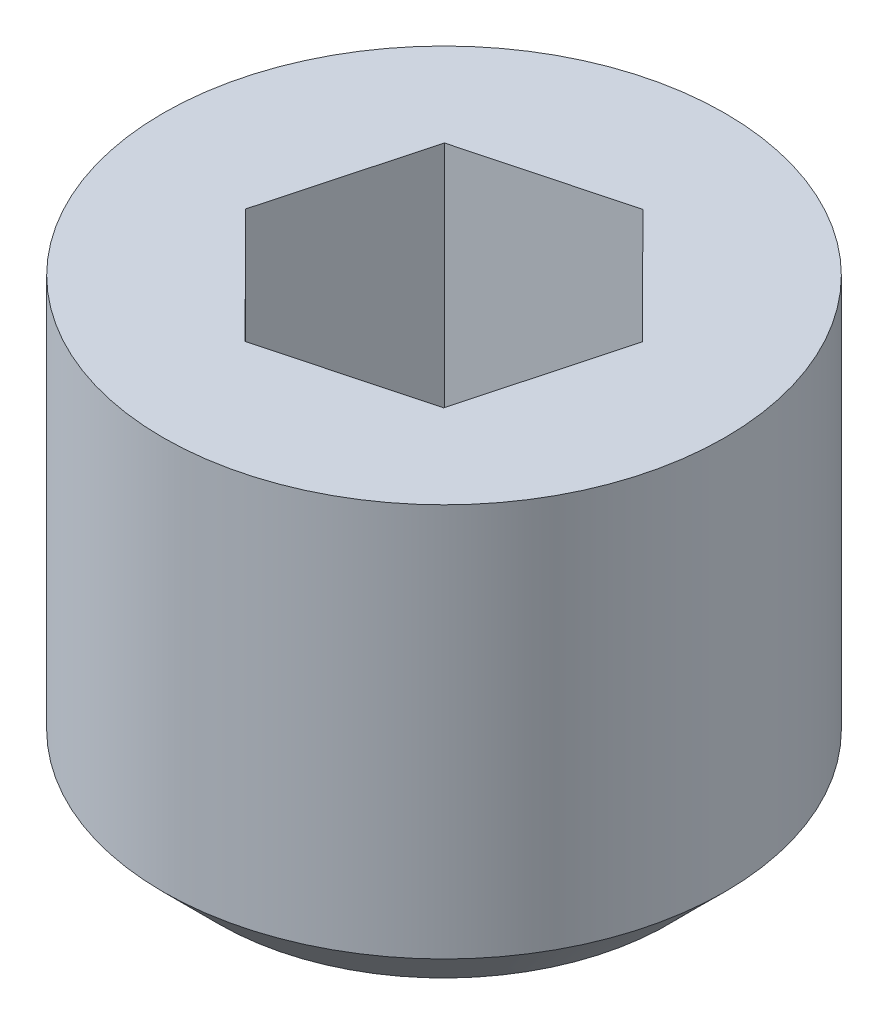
ISO-10303-21;
HEADER;
FILE_DESCRIPTION(('STEP AP214'),'2;1');
FILE_NAME('part.step','',(''),(''),'','','');
FILE_SCHEMA(('AUTOMOTIVE_DESIGN { 1 0 10303 214 1 1 1 1 }'));
ENDSEC;
DATA;
#1=APPLICATION_CONTEXT('core data for automotive mechanical design processes');
#2=APPLICATION_PROTOCOL_DEFINITION('international standard','automotive_design',2000,#1);
#3=PRODUCT_CONTEXT('',#1,'mechanical');
#4=PRODUCT('Part','Part','',(#3));
#5=PRODUCT_RELATED_PRODUCT_CATEGORY('part','',(#4));
#6=PRODUCT_DEFINITION_FORMATION('','',#4);
#7=PRODUCT_DEFINITION_CONTEXT('part definition',#1,'design');
#8=PRODUCT_DEFINITION('design','',#6,#7);
#9=PRODUCT_DEFINITION_SHAPE('','',#8);
#10=(LENGTH_UNIT() NAMED_UNIT(*) SI_UNIT(.MILLI.,.METRE.));
#11=(NAMED_UNIT(*) PLANE_ANGLE_UNIT() SI_UNIT($,.RADIAN.));
#12=(NAMED_UNIT(*) SI_UNIT($,.STERADIAN.) SOLID_ANGLE_UNIT());
#13=UNCERTAINTY_MEASURE_WITH_UNIT(LENGTH_MEASURE(1.E-05),#10,'distance_accuracy_value','');
#14=(GEOMETRIC_REPRESENTATION_CONTEXT(3) GLOBAL_UNCERTAINTY_ASSIGNED_CONTEXT((#13)) GLOBAL_UNIT_ASSIGNED_CONTEXT((#10,
#11,#12)) REPRESENTATION_CONTEXT('',''));
#15=CARTESIAN_POINT('',(0.,0.,0.));
#16=DIRECTION('',(0.,0.,1.));
#17=DIRECTION('',(1.,0.,0.));
#18=AXIS2_PLACEMENT_3D('',#15,#16,#17);
#19=CARTESIAN_POINT('',(2.,0.,0.));
#20=DIRECTION('',(0.,-1.,0.));
#21=DIRECTION('',(0.,0.,-1.));
#22=AXIS2_PLACEMENT_3D('',#19,#20,#21);
#23=PLANE('',#22);
#24=CARTESIAN_POINT('',(0.,0.,0.));
#25=DIRECTION('',(0.,-1.,0.));
#26=DIRECTION('',(0.,0.,-1.));
#27=AXIS2_PLACEMENT_3D('',#24,#25,#26);
#28=CIRCLE('',#27,2.);
#29=CARTESIAN_POINT('',(0.,0.,-2.));
#30=VERTEX_POINT('',#29);
#31=EDGE_CURVE('E136',#30,#30,#28,.T.);
#32=ORIENTED_EDGE('',*,*,#31,.T.);
#33=EDGE_LOOP('',(#32));
#34=FACE_BOUND('',#33,.T.);
#35=ADVANCED_FACE('F35',(#34),#23,.T.);
#36=CARTESIAN_POINT('',(0.,4.,0.));
#37=DIRECTION('',(0.,1.,0.));
#38=DIRECTION('',(0.,0.,1.));
#39=AXIS2_PLACEMENT_3D('',#36,#37,#38);
#40=PLANE('',#39);
#41=DIRECTION('',(0.966397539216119,0.,-0.25705212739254));
#42=VECTOR('',#41,1.);
#43=CARTESIAN_POINT('',(-0.376122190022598,4.,1.39350831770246));
#44=LINE('',#43,#42);
#45=CARTESIAN_POINT('',(-0.376122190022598,4.,1.39350831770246));
#46=VERTEX_POINT('',#45);
#47=CARTESIAN_POINT('',(1.01875250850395,4.,1.02248553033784));
#48=VERTEX_POINT('',#47);
#49=EDGE_CURVE('E49',#46,#48,#44,.T.);
#50=ORIENTED_EDGE('',*,*,#49,.F.);
#51=DIRECTION('',(0.705812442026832,0.,0.708398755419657));
#52=VECTOR('',#51,1.);
#53=CARTESIAN_POINT('',(-1.39487469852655,4.,0.371022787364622));
#54=LINE('',#53,#52);
#55=CARTESIAN_POINT('',(-1.39487469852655,4.,0.371022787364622));
#56=VERTEX_POINT('',#55);
#57=EDGE_CURVE('E132',#56,#46,#54,.T.);
#58=ORIENTED_EDGE('',*,*,#57,.F.);
#59=DIRECTION('',(-0.260585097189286,0.,0.965450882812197));
#60=VECTOR('',#59,1.);
#61=CARTESIAN_POINT('',(-1.01875250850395,4.,-1.02248553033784));
#62=LINE('',#61,#60);
#63=CARTESIAN_POINT('',(-1.01875250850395,4.,-1.02248553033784));
#64=VERTEX_POINT('',#63);
#65=EDGE_CURVE('E130',#64,#56,#62,.T.);
#66=ORIENTED_EDGE('',*,*,#65,.F.);
#67=DIRECTION('',(-0.966397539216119,0.,0.25705212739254));
#68=VECTOR('',#67,1.);
#69=CARTESIAN_POINT('',(0.376122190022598,4.,-1.39350831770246));
#70=LINE('',#69,#68);
#71=CARTESIAN_POINT('',(0.376122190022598,4.,-1.39350831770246));
#72=VERTEX_POINT('',#71);
#73=EDGE_CURVE('E97',#72,#64,#70,.T.);
#74=ORIENTED_EDGE('',*,*,#73,.F.);
#75=DIRECTION('',(-0.705812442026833,0.,-0.708398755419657));
#76=VECTOR('',#75,1.);
#77=CARTESIAN_POINT('',(1.39487469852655,4.,-0.371022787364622));
#78=LINE('',#77,#76);
#79=CARTESIAN_POINT('',(1.39487469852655,4.,-0.371022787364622));
#80=VERTEX_POINT('',#79);
#81=EDGE_CURVE('E126',#80,#72,#78,.T.);
#82=ORIENTED_EDGE('',*,*,#81,.F.);
#83=DIRECTION('',(0.260585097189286,0.,-0.965450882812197));
#84=VECTOR('',#83,1.);
#85=CARTESIAN_POINT('',(1.01875250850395,4.,1.02248553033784));
#86=LINE('',#85,#84);
#87=EDGE_CURVE('E123',#48,#80,#86,.T.);
#88=ORIENTED_EDGE('',*,*,#87,.F.);
#89=EDGE_LOOP('',(#50,#58,#66,#74,#82,#88));
#90=FACE_BOUND('',#89,.T.);
#91=CARTESIAN_POINT('',(0.,4.,0.));
#92=DIRECTION('',(0.,-1.,0.));
#93=DIRECTION('',(0.,0.,-1.));
#94=AXIS2_PLACEMENT_3D('',#91,#92,#93);
#95=CIRCLE('',#94,2.5);
#96=CARTESIAN_POINT('',(0.,4.,-2.5));
#97=VERTEX_POINT('',#96);
#98=EDGE_CURVE('E11',#97,#97,#95,.T.);
#99=ORIENTED_EDGE('',*,*,#98,.F.);
#100=EDGE_LOOP('',(#99));
#101=FACE_BOUND('',#100,.T.);
#102=ADVANCED_FACE('F151',(#90,#101),#40,.T.);
#103=CARTESIAN_POINT('',(0.,0.,0.));
#104=DIRECTION('',(0.,-1.,0.));
#105=DIRECTION('',(0.,0.,-1.));
#106=AXIS2_PLACEMENT_3D('',#103,#104,#105);
#107=CYLINDRICAL_SURFACE('',#106,2.5);
#108=ORIENTED_EDGE('',*,*,#98,.T.);
#109=EDGE_LOOP('',(#108));
#110=FACE_BOUND('',#109,.T.);
#111=CARTESIAN_POINT('',(0.,0.499999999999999,0.));
#112=DIRECTION('',(0.,-1.,0.));
#113=DIRECTION('',(0.,0.,-1.));
#114=AXIS2_PLACEMENT_3D('',#111,#112,#113);
#115=CIRCLE('',#114,2.5);
#116=CARTESIAN_POINT('',(0.,0.499999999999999,-2.5));
#117=VERTEX_POINT('',#116);
#118=EDGE_CURVE('E42',#117,#117,#115,.T.);
#119=ORIENTED_EDGE('',*,*,#118,.F.);
#120=EDGE_LOOP('',(#119));
#121=FACE_BOUND('',#120,.T.);
#122=ADVANCED_FACE('F149',(#110,#121),#107,.T.);
#123=CARTESIAN_POINT('',(0.,0.,0.));
#124=DIRECTION('',(0.,1.,0.));
#125=DIRECTION('',(0.,0.,1.));
#126=AXIS2_PLACEMENT_3D('',#123,#124,#125);
#127=CONICAL_SURFACE('',#126,2.,0.785398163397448);
#128=ORIENTED_EDGE('',*,*,#118,.T.);
#129=EDGE_LOOP('',(#128));
#130=FACE_BOUND('',#129,.T.);
#131=ORIENTED_EDGE('',*,*,#31,.F.);
#132=EDGE_LOOP('',(#131));
#133=FACE_BOUND('',#132,.T.);
#134=ADVANCED_FACE('F146',(#130,#133),#127,.T.);
#135=CARTESIAN_POINT('',(-0.376122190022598,1.5,1.39350831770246));
#136=DIRECTION('',(0.25705212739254,0.,0.966397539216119));
#137=DIRECTION('',(0.966397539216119,0.,-0.25705212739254));
#138=AXIS2_PLACEMENT_3D('',#135,#136,#137);
#139=PLANE('',#138);
#140=ORIENTED_EDGE('',*,*,#49,.T.);
#141=DIRECTION('',(0.,1.,0.));
#142=VECTOR('',#141,1.);
#143=CARTESIAN_POINT('',(1.01875250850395,1.5,1.02248553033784));
#144=LINE('',#143,#142);
#145=CARTESIAN_POINT('',(1.01875250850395,1.5,1.02248553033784));
#146=VERTEX_POINT('',#145);
#147=EDGE_CURVE('E79',#146,#48,#144,.T.);
#148=ORIENTED_EDGE('',*,*,#147,.F.);
#149=DIRECTION('',(0.966397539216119,0.,-0.25705212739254));
#150=VECTOR('',#149,1.);
#151=CARTESIAN_POINT('',(-0.376122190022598,1.5,1.39350831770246));
#152=LINE('',#151,#150);
#153=CARTESIAN_POINT('',(-0.376122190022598,1.5,1.39350831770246));
#154=VERTEX_POINT('',#153);
#155=EDGE_CURVE('E134',#154,#146,#152,.T.);
#156=ORIENTED_EDGE('',*,*,#155,.F.);
#157=DIRECTION('',(0.,1.,0.));
#158=VECTOR('',#157,1.);
#159=CARTESIAN_POINT('',(-0.376122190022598,1.5,1.39350831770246));
#160=LINE('',#159,#158);
#161=EDGE_CURVE('E57',#154,#46,#160,.T.);
#162=ORIENTED_EDGE('',*,*,#161,.T.);
#163=EDGE_LOOP('',(#140,#148,#156,#162));
#164=FACE_BOUND('',#163,.T.);
#165=ADVANCED_FACE('F158',(#164),#139,.F.);
#166=CARTESIAN_POINT('',(-1.39487469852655,1.5,0.371022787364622));
#167=DIRECTION('',(-0.708398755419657,0.,0.705812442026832));
#168=DIRECTION('',(0.705812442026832,0.,0.708398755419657));
#169=AXIS2_PLACEMENT_3D('',#166,#167,#168);
#170=PLANE('',#169);
#171=ORIENTED_EDGE('',*,*,#57,.T.);
#172=ORIENTED_EDGE('',*,*,#161,.F.);
#173=DIRECTION('',(0.705812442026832,0.,0.708398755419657));
#174=VECTOR('',#173,1.);
#175=CARTESIAN_POINT('',(-1.39487469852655,1.5,0.371022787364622));
#176=LINE('',#175,#174);
#177=CARTESIAN_POINT('',(-1.39487469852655,1.5,0.371022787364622));
#178=VERTEX_POINT('',#177);
#179=EDGE_CURVE('E109',#178,#154,#176,.T.);
#180=ORIENTED_EDGE('',*,*,#179,.F.);
#181=DIRECTION('',(0.,1.,0.));
#182=VECTOR('',#181,1.);
#183=CARTESIAN_POINT('',(-1.39487469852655,1.5,0.371022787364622));
#184=LINE('',#183,#182);
#185=EDGE_CURVE('E101',#178,#56,#184,.T.);
#186=ORIENTED_EDGE('',*,*,#185,.T.);
#187=EDGE_LOOP('',(#171,#172,#180,#186));
#188=FACE_BOUND('',#187,.T.);
#189=ADVANCED_FACE('F183',(#188),#170,.F.);
#190=CARTESIAN_POINT('',(-1.01875250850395,1.5,-1.02248553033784));
#191=DIRECTION('',(-0.965450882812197,0.,-0.260585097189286));
#192=DIRECTION('',(-0.260585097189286,0.,0.965450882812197));
#193=AXIS2_PLACEMENT_3D('',#190,#191,#192);
#194=PLANE('',#193);
#195=ORIENTED_EDGE('',*,*,#65,.T.);
#196=ORIENTED_EDGE('',*,*,#185,.F.);
#197=DIRECTION('',(-0.260585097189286,0.,0.965450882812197));
#198=VECTOR('',#197,1.);
#199=CARTESIAN_POINT('',(-1.01875250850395,1.5,-1.02248553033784));
#200=LINE('',#199,#198);
#201=CARTESIAN_POINT('',(-1.01875250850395,1.5,-1.02248553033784));
#202=VERTEX_POINT('',#201);
#203=EDGE_CURVE('E105',#202,#178,#200,.T.);
#204=ORIENTED_EDGE('',*,*,#203,.F.);
#205=DIRECTION('',(0.,1.,0.));
#206=VECTOR('',#205,1.);
#207=CARTESIAN_POINT('',(-1.01875250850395,1.5,-1.02248553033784));
#208=LINE('',#207,#206);
#209=EDGE_CURVE('E90',#202,#64,#208,.T.);
#210=ORIENTED_EDGE('',*,*,#209,.T.);
#211=EDGE_LOOP('',(#195,#196,#204,#210));
#212=FACE_BOUND('',#211,.T.);
#213=ADVANCED_FACE('F106',(#212),#194,.F.);
#214=CARTESIAN_POINT('',(0.376122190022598,1.5,-1.39350831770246));
#215=DIRECTION('',(-0.25705212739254,0.,-0.966397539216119));
#216=DIRECTION('',(-0.966397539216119,0.,0.25705212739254));
#217=AXIS2_PLACEMENT_3D('',#214,#215,#216);
#218=PLANE('',#217);
#219=ORIENTED_EDGE('',*,*,#73,.T.);
#220=ORIENTED_EDGE('',*,*,#209,.F.);
#221=DIRECTION('',(-0.966397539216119,0.,0.25705212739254));
#222=VECTOR('',#221,1.);
#223=CARTESIAN_POINT('',(0.376122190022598,1.5,-1.39350831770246));
#224=LINE('',#223,#222);
#225=CARTESIAN_POINT('',(0.376122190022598,1.5,-1.39350831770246));
#226=VERTEX_POINT('',#225);
#227=EDGE_CURVE('E94',#226,#202,#224,.T.);
#228=ORIENTED_EDGE('',*,*,#227,.F.);
#229=DIRECTION('',(0.,1.,0.));
#230=VECTOR('',#229,1.);
#231=CARTESIAN_POINT('',(0.376122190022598,1.5,-1.39350831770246));
#232=LINE('',#231,#230);
#233=EDGE_CURVE('E102',#226,#72,#232,.T.);
#234=ORIENTED_EDGE('',*,*,#233,.T.);
#235=EDGE_LOOP('',(#219,#220,#228,#234));
#236=FACE_BOUND('',#235,.T.);
#237=ADVANCED_FACE('F92',(#236),#218,.F.);
#238=CARTESIAN_POINT('',(1.39487469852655,1.5,-0.371022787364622));
#239=DIRECTION('',(0.708398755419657,0.,-0.705812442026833));
#240=DIRECTION('',(-0.705812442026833,0.,-0.708398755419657));
#241=AXIS2_PLACEMENT_3D('',#238,#239,#240);
#242=PLANE('',#241);
#243=ORIENTED_EDGE('',*,*,#81,.T.);
#244=ORIENTED_EDGE('',*,*,#233,.F.);
#245=DIRECTION('',(-0.705812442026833,0.,-0.708398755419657));
#246=VECTOR('',#245,1.);
#247=CARTESIAN_POINT('',(1.39487469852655,1.5,-0.371022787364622));
#248=LINE('',#247,#246);
#249=CARTESIAN_POINT('',(1.39487469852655,1.5,-0.371022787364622));
#250=VERTEX_POINT('',#249);
#251=EDGE_CURVE('E115',#250,#226,#248,.T.);
#252=ORIENTED_EDGE('',*,*,#251,.F.);
#253=DIRECTION('',(0.,1.,0.));
#254=VECTOR('',#253,1.);
#255=CARTESIAN_POINT('',(1.39487469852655,1.5,-0.371022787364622));
#256=LINE('',#255,#254);
#257=EDGE_CURVE('E139',#250,#80,#256,.T.);
#258=ORIENTED_EDGE('',*,*,#257,.T.);
#259=EDGE_LOOP('',(#243,#244,#252,#258));
#260=FACE_BOUND('',#259,.T.);
#261=ADVANCED_FACE('F208',(#260),#242,.F.);
#262=CARTESIAN_POINT('',(1.01875250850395,1.5,1.02248553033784));
#263=DIRECTION('',(0.965450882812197,0.,0.260585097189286));
#264=DIRECTION('',(0.260585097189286,0.,-0.965450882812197));
#265=AXIS2_PLACEMENT_3D('',#262,#263,#264);
#266=PLANE('',#265);
#267=ORIENTED_EDGE('',*,*,#87,.T.);
#268=ORIENTED_EDGE('',*,*,#257,.F.);
#269=DIRECTION('',(0.260585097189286,0.,-0.965450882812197));
#270=VECTOR('',#269,1.);
#271=CARTESIAN_POINT('',(1.01875250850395,1.5,1.02248553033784));
#272=LINE('',#271,#270);
#273=EDGE_CURVE('E117',#146,#250,#272,.T.);
#274=ORIENTED_EDGE('',*,*,#273,.F.);
#275=ORIENTED_EDGE('',*,*,#147,.T.);
#276=EDGE_LOOP('',(#267,#268,#274,#275));
#277=FACE_BOUND('',#276,.T.);
#278=ADVANCED_FACE('F217',(#277),#266,.F.);
#279=CARTESIAN_POINT('',(0.,1.5,0.));
#280=DIRECTION('',(0.,1.,0.));
#281=DIRECTION('',(0.,0.,1.));
#282=AXIS2_PLACEMENT_3D('',#279,#280,#281);
#283=PLANE('',#282);
#284=ORIENTED_EDGE('',*,*,#155,.T.);
#285=ORIENTED_EDGE('',*,*,#273,.T.);
#286=ORIENTED_EDGE('',*,*,#251,.T.);
#287=ORIENTED_EDGE('',*,*,#227,.T.);
#288=ORIENTED_EDGE('',*,*,#203,.T.);
#289=ORIENTED_EDGE('',*,*,#179,.T.);
#290=EDGE_LOOP('',(#284,#285,#286,#287,#288,#289));
#291=FACE_BOUND('',#290,.T.);
#292=ADVANCED_FACE('F112',(#291),#283,.T.);
#293=CLOSED_SHELL('',(#35,#102,#122,#134,#165,#189,#213,#237,#261,#278,#292));
#294=MANIFOLD_SOLID_BREP('B2',#293);
#295=ADVANCED_BREP_SHAPE_REPRESENTATION('',(#18,#294),#14);
#296=SHAPE_DEFINITION_REPRESENTATION(#9,#295);
ENDSEC;
END-ISO-10303-21;
